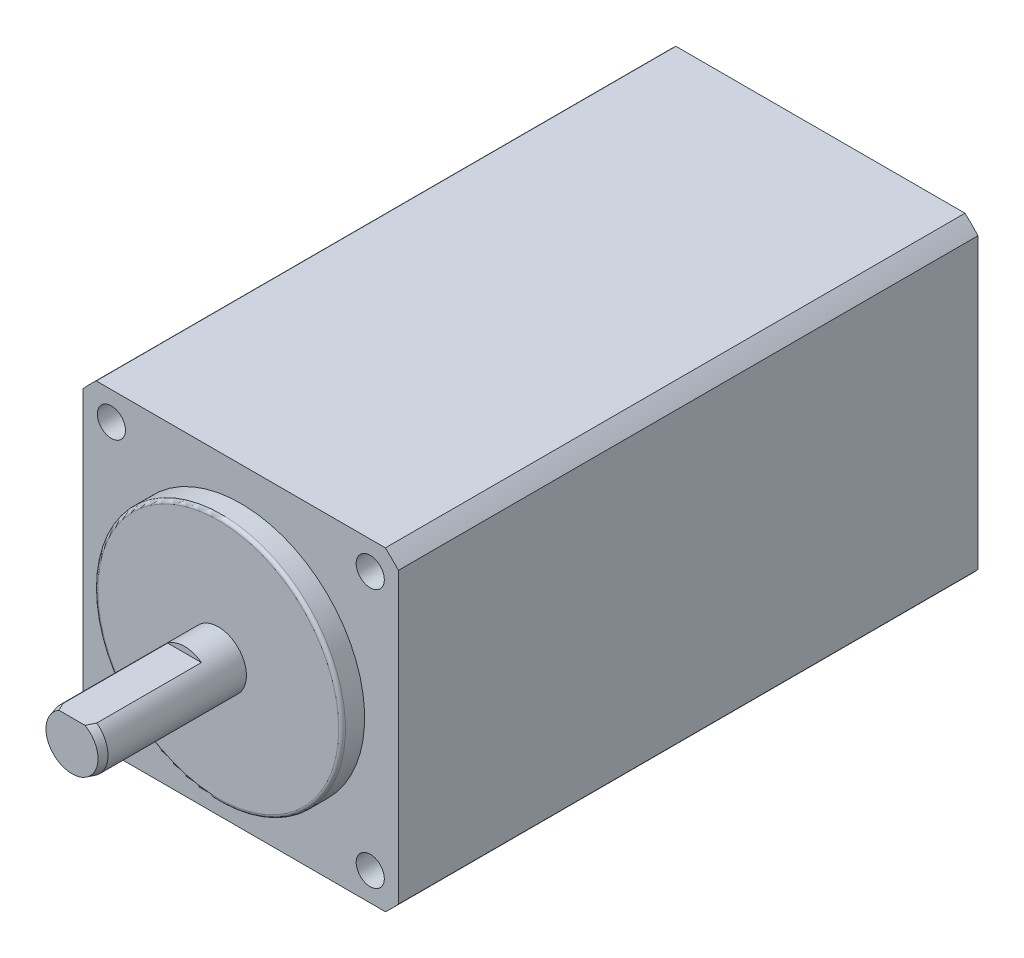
from build123d import *

# Parameters (mm, degrees)
SKETCH1_R      = 2.5
EXTRUDE1_DEPTH = 15
SKETCH2_R      = 11
EXTRUDE2_DEPTH = 2
EXTRUDE3_DEPTH = 51.5
SKETCH4_W      = 15.2
SKETCH4_H      = 9.5
EXTRUDE4_DEPTH = 5
SKETCH5_W      = 5.160305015
SKETCH5_H      = 2.199474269
EXTRUDE5_DEPTH = 10
CHAMFER1_SIZE  = 0.7
CHAMFER1_SIZE2 = 0.187564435
SKETCH6_R      = 1.25
EXTRUDE6_DEPTH = 4.5
FILLET2_R      = 0.3


with BuildPart() as part:
    # Sketch1 → Extrude1 (new body)
    with BuildSketch(Plane.XY):
        Circle(SKETCH1_R)
    extrude(amount=EXTRUDE1_DEPTH)

    # Sketch2 → Extrude2 (add)
    with BuildSketch(Plane(origin=(0, 0, 0), x_dir=(-1, 0, 0), z_dir=(0, 0, -1))):
        Circle(SKETCH2_R)
    extrude(amount=-EXTRUDE2_DEPTH)

    # Sketch5 → Extrude5 (cut)
    with BuildSketch(Plane.XY.offset(15)):
        with Locations((0.042297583, 3.099737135)):
            Rectangle(SKETCH5_W, SKETCH5_H)
    extrude(amount=-EXTRUDE5_DEPTH, mode=Mode.SUBTRACT)

    # Chamfer1
    chamfer1_edges = [part.edges().sort_by_distance(p)[0] for p in [
        (-1.118033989, -2.236067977, 15),
    ]]
    chamfer1_side = [part.faces().sort_by_distance(p)[0] for p in [
        (-2.5, 0, 8.5),
    ]]
    chamfer(chamfer1_edges, length=CHAMFER1_SIZE, length2=CHAMFER1_SIZE2, reference=chamfer1_side[0])

    # Fillet2
    fillet2_edges = [part.edges().sort_by_distance(p)[0] for p in [
        (11, 0, 2),
    ]]
    fillet(fillet2_edges, radius=FILLET2_R)


with BuildPart() as body_2:
    # Sketch3 → Extrude3 (new body)
    with BuildSketch(Plane(origin=(0, 0, 0), x_dir=(-1, 0, 0), z_dir=(0, 0, -1))):
        with BuildLine():
            Line((-12.845232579, -14), (12.845232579, -14))
            ThreePointArc((12.845232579, -14), (13.435028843, -13.435028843), (14, -12.845232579))
            Line((14, -12.845232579), (14, 12.845232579))
            ThreePointArc((14, 12.845232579), (13.435028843, 13.435028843), (12.845232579, 14))
            Line((12.845232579, 14), (-12.845232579, 14))
            ThreePointArc((-12.845232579, 14), (-13.435028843, 13.435028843), (-14, 12.845232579))
            Line((-14, 12.845232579), (-14, -12.845232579))
            ThreePointArc((-14, -12.845232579), (-13.435028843, -13.435028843), (-12.845232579, -14))
        make_face()
    extrude(amount=EXTRUDE3_DEPTH)

    # Sketch4 → Extrude4 (add)
    with BuildSketch(Plane.XZ.offset(14)):
        with Locations((0, -46.75)):
            Rectangle(SKETCH4_W, SKETCH4_H)
    extrude(amount=EXTRUDE4_DEPTH)

    # Sketch6 → Extrude6 (cut)
    with BuildSketch(Plane.XY):
        with Locations((-11.5, 11.5)):
            Circle(SKETCH6_R)
        with Locations((11.5, 11.5)):
            Circle(SKETCH6_R)
        with Locations((-11.5, -11.5)):
            Circle(SKETCH6_R)
        with Locations((11.5, -11.5)):
            Circle(SKETCH6_R)
    extrude(amount=-EXTRUDE6_DEPTH, mode=Mode.SUBTRACT)


solid = Compound([part.part, body_2.part])
